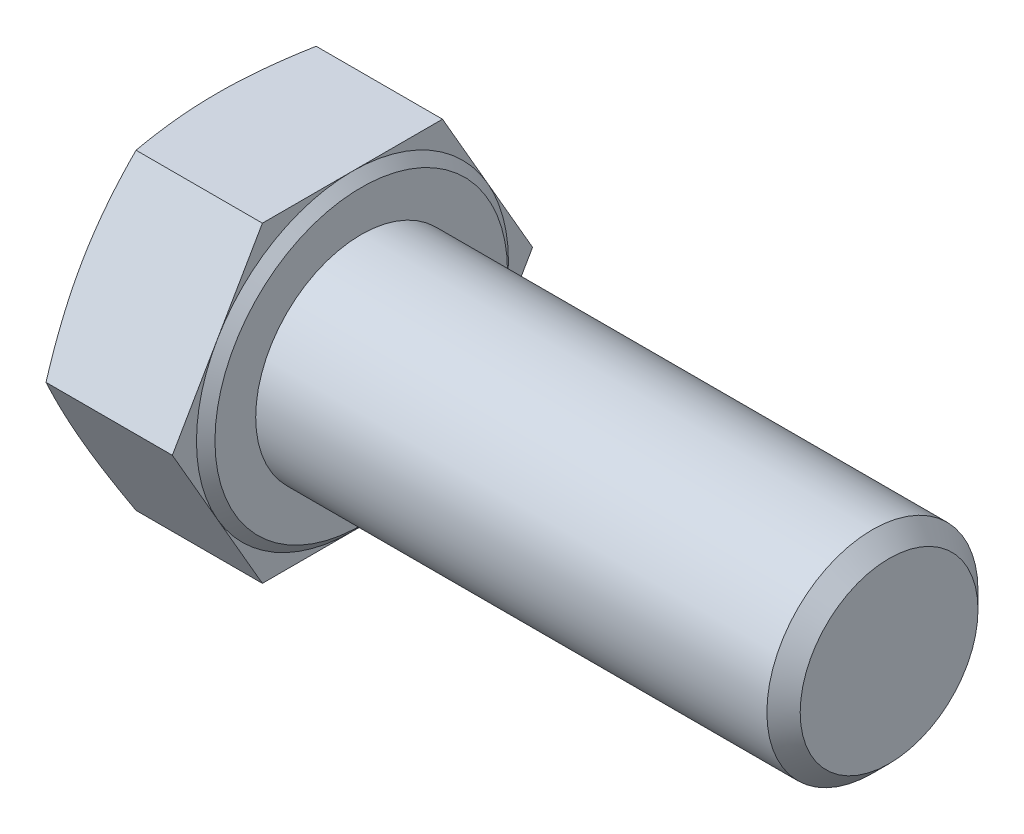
from build123d import *

# Parameters (mm, degrees)
BASEHEAD_DEPTH = 7.68
SKETCH3_R      = 6
BASEBODY_DEPTH = 30
CHAMFER1_SIZE  = 0.947


with BuildPart() as part:
    # Sketch-BaseHead → BaseHead (new body)
    with BuildSketch(Plane(origin=(0, 0, 0), x_dir=(0, 0, -1), z_dir=(1, 0, 0))):
        Polygon((10.236420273, 0), (5.118210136, 8.865), (-5.118210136, 8.865), (-10.236420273, 0), (-5.118210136, -8.865), (5.118210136, -8.865), align=None)
    extrude(amount=BASEHEAD_DEPTH)

    # Sketch4 → HeadChamfer (revolve, cut)
    with BuildSketch(Plane(origin=(-0.264637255, 0, 5.916896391), x_dir=(0, 0, -1), z_dir=(0, 1, 0))):
        Polygon((16.153316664, -0.264637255), (14.781896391, -0.264637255), (16.153316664, -0.763793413), align=None)
    revolve(axis=Axis((-4.001564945, 0, 0), (1, 0, 0)), mode=Mode.SUBTRACT)

    # Sketch1 → Revolve1 (revolve)
    with BuildSketch(Plane.XY, mode=Mode.PRIVATE) as revolve1_sk:
        Polygon((7.68, 0), (8.18, 0), (8.18, -8.315), (7.68, -8.865), align=None)
    revolve(revolve1_sk.sketch.rotate(Axis((-4.001564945, 0, 0), (1, 0, 0)), 270), axis=Axis((-4.001564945, 0, 0), (1, 0, 0)))

    # Sketch3 → BaseBody (add)
    with BuildSketch(Plane(origin=(8.18, 0, 0), x_dir=(0, 0, -1), z_dir=(1, 0, 0))):
        Circle(SKETCH3_R)
    extrude(amount=BASEBODY_DEPTH)

    # Chamfer1
    chamfer1_edges = [part.edges().sort_by_distance(p)[0] for p in [
        (38.18, 0, 6),
    ]]
    chamfer(chamfer1_edges, length=CHAMFER1_SIZE)


solid = part.part
